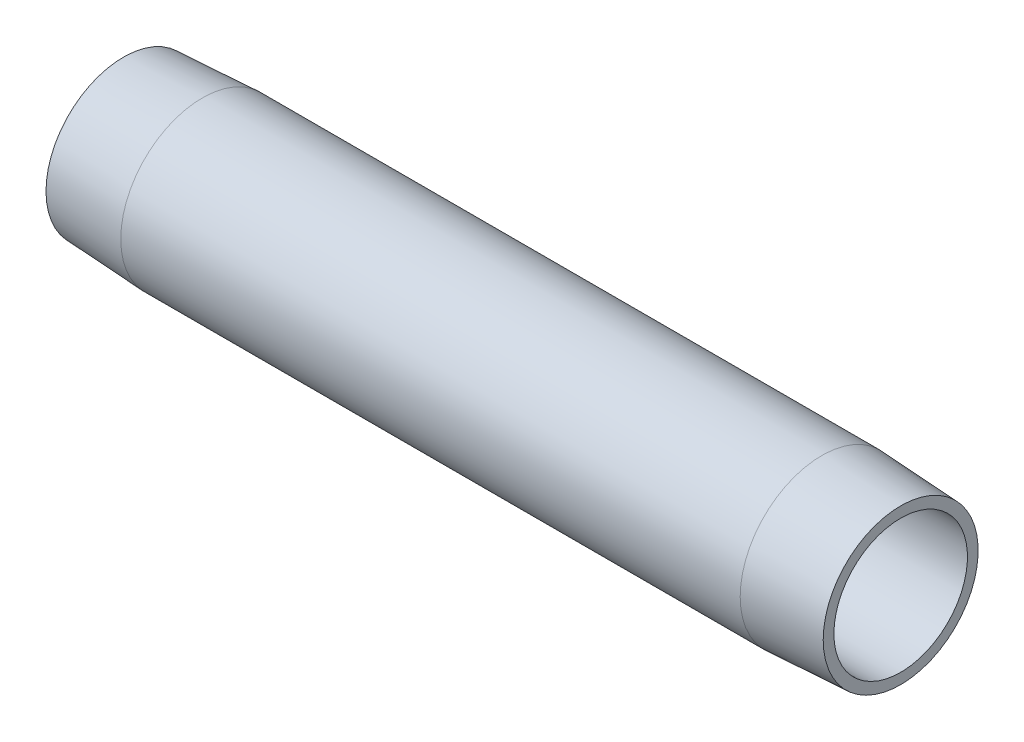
ISO-10303-21;
HEADER;
FILE_DESCRIPTION(('STEP AP214'),'2;1');
FILE_NAME('part.step','',(''),(''),'','','');
FILE_SCHEMA(('AUTOMOTIVE_DESIGN { 1 0 10303 214 1 1 1 1 }'));
ENDSEC;
DATA;
#1=APPLICATION_CONTEXT('core data for automotive mechanical design processes');
#2=APPLICATION_PROTOCOL_DEFINITION('international standard','automotive_design',2000,#1);
#3=PRODUCT_CONTEXT('',#1,'mechanical');
#4=PRODUCT('Part','Part','',(#3));
#5=PRODUCT_RELATED_PRODUCT_CATEGORY('part','',(#4));
#6=PRODUCT_DEFINITION_FORMATION('','',#4);
#7=PRODUCT_DEFINITION_CONTEXT('part definition',#1,'design');
#8=PRODUCT_DEFINITION('design','',#6,#7);
#9=PRODUCT_DEFINITION_SHAPE('','',#8);
#10=(LENGTH_UNIT() NAMED_UNIT(*) SI_UNIT(.MILLI.,.METRE.));
#11=(NAMED_UNIT(*) PLANE_ANGLE_UNIT() SI_UNIT($,.RADIAN.));
#12=(NAMED_UNIT(*) SI_UNIT($,.STERADIAN.) SOLID_ANGLE_UNIT());
#13=UNCERTAINTY_MEASURE_WITH_UNIT(LENGTH_MEASURE(1.E-05),#10,'distance_accuracy_value','');
#14=(GEOMETRIC_REPRESENTATION_CONTEXT(3) GLOBAL_UNCERTAINTY_ASSIGNED_CONTEXT((#13)) GLOBAL_UNIT_ASSIGNED_CONTEXT((#10,
#11,#12)) REPRESENTATION_CONTEXT('',''));
#15=CARTESIAN_POINT('',(0.,0.,0.));
#16=DIRECTION('',(0.,0.,1.));
#17=DIRECTION('',(1.,0.,0.));
#18=AXIS2_PLACEMENT_3D('',#15,#16,#17);
#19=CARTESIAN_POINT('',(101.6,8.73125,0.));
#20=DIRECTION('',(-1.,0.,0.));
#21=DIRECTION('',(0.,0.,1.));
#22=AXIS2_PLACEMENT_3D('',#19,#20,#21);
#23=PLANE('',#22);
#24=CARTESIAN_POINT('',(101.6,0.,0.));
#25=DIRECTION('',(-1.,0.,0.));
#26=DIRECTION('',(0.,0.,1.));
#27=AXIS2_PLACEMENT_3D('',#24,#25,#26);
#28=CIRCLE('',#27,10.1275500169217);
#29=CARTESIAN_POINT('',(101.6,0.,10.1275500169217));
#30=VERTEX_POINT('',#29);
#31=EDGE_CURVE('E10',#30,#30,#28,.T.);
#32=ORIENTED_EDGE('',*,*,#31,.F.);
#33=EDGE_LOOP('',(#32));
#34=FACE_BOUND('',#33,.T.);
#35=CARTESIAN_POINT('',(101.6,0.,0.));
#36=DIRECTION('',(-1.,0.,0.));
#37=DIRECTION('',(0.,0.,1.));
#38=AXIS2_PLACEMENT_3D('',#35,#36,#37);
#39=CIRCLE('',#38,8.73125);
#40=CARTESIAN_POINT('',(101.6,0.,8.73125));
#41=VERTEX_POINT('',#40);
#42=EDGE_CURVE('E52',#41,#41,#39,.T.);
#43=ORIENTED_EDGE('',*,*,#42,.T.);
#44=EDGE_LOOP('',(#43));
#45=FACE_BOUND('',#44,.T.);
#46=ADVANCED_FACE('F30',(#34,#45),#23,.F.);
#47=CARTESIAN_POINT('',(101.6,0.,0.));
#48=DIRECTION('',(-1.,0.,0.));
#49=DIRECTION('',(0.,0.,1.));
#50=AXIS2_PLACEMENT_3D('',#47,#48,#49);
#51=CONICAL_SURFACE('',#50,10.1275500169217,0.0523598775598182);
#52=CARTESIAN_POINT('',(91.2876,0.,0.));
#53=DIRECTION('',(-1.,0.,0.));
#54=DIRECTION('',(0.,0.,1.));
#55=AXIS2_PLACEMENT_3D('',#52,#53,#54);
#56=CIRCLE('',#55,10.668);
#57=CARTESIAN_POINT('',(91.2876,0.,10.668));
#58=VERTEX_POINT('',#57);
#59=EDGE_CURVE('E36',#58,#58,#56,.T.);
#60=ORIENTED_EDGE('',*,*,#59,.F.);
#61=EDGE_LOOP('',(#60));
#62=FACE_BOUND('',#61,.T.);
#63=ORIENTED_EDGE('',*,*,#31,.T.);
#64=EDGE_LOOP('',(#63));
#65=FACE_BOUND('',#64,.T.);
#66=ADVANCED_FACE('F77',(#62,#65),#51,.T.);
#67=CARTESIAN_POINT('',(0.,0.,0.));
#68=DIRECTION('',(-1.,0.,0.));
#69=DIRECTION('',(0.,0.,1.));
#70=AXIS2_PLACEMENT_3D('',#67,#68,#69);
#71=CYLINDRICAL_SURFACE('',#70,10.668);
#72=CARTESIAN_POINT('',(10.3124,0.,0.));
#73=DIRECTION('',(-1.,0.,0.));
#74=DIRECTION('',(0.,0.,1.));
#75=AXIS2_PLACEMENT_3D('',#72,#73,#74);
#76=CIRCLE('',#75,10.668);
#77=CARTESIAN_POINT('',(10.3124,0.,10.668));
#78=VERTEX_POINT('',#77);
#79=EDGE_CURVE('E40',#78,#78,#76,.T.);
#80=ORIENTED_EDGE('',*,*,#79,.F.);
#81=EDGE_LOOP('',(#80));
#82=FACE_BOUND('',#81,.T.);
#83=ORIENTED_EDGE('',*,*,#59,.T.);
#84=EDGE_LOOP('',(#83));
#85=FACE_BOUND('',#84,.T.);
#86=ADVANCED_FACE('F72',(#82,#85),#71,.T.);
#87=CARTESIAN_POINT('',(10.3124,0.,0.));
#88=DIRECTION('',(1.,0.,0.));
#89=DIRECTION('',(0.,0.,-1.));
#90=AXIS2_PLACEMENT_3D('',#87,#88,#89);
#91=CONICAL_SURFACE('',#90,10.668,0.0523598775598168);
#92=CARTESIAN_POINT('',(0.,0.,0.));
#93=DIRECTION('',(-1.,0.,0.));
#94=DIRECTION('',(0.,0.,1.));
#95=AXIS2_PLACEMENT_3D('',#92,#93,#94);
#96=CIRCLE('',#95,10.1275500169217);
#97=CARTESIAN_POINT('',(0.,0.,10.1275500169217));
#98=VERTEX_POINT('',#97);
#99=EDGE_CURVE('E44',#98,#98,#96,.T.);
#100=ORIENTED_EDGE('',*,*,#99,.F.);
#101=EDGE_LOOP('',(#100));
#102=FACE_BOUND('',#101,.T.);
#103=ORIENTED_EDGE('',*,*,#79,.T.);
#104=EDGE_LOOP('',(#103));
#105=FACE_BOUND('',#104,.T.);
#106=ADVANCED_FACE('F66',(#102,#105),#91,.T.);
#107=CARTESIAN_POINT('',(0.,10.1275500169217,0.));
#108=DIRECTION('',(1.,0.,0.));
#109=DIRECTION('',(0.,0.,-1.));
#110=AXIS2_PLACEMENT_3D('',#107,#108,#109);
#111=PLANE('',#110);
#112=CARTESIAN_POINT('',(0.,0.,0.));
#113=DIRECTION('',(-1.,0.,0.));
#114=DIRECTION('',(0.,0.,1.));
#115=AXIS2_PLACEMENT_3D('',#112,#113,#114);
#116=CIRCLE('',#115,8.73125);
#117=CARTESIAN_POINT('',(0.,0.,8.73125));
#118=VERTEX_POINT('',#117);
#119=EDGE_CURVE('E49',#118,#118,#116,.T.);
#120=ORIENTED_EDGE('',*,*,#119,.F.);
#121=EDGE_LOOP('',(#120));
#122=FACE_BOUND('',#121,.T.);
#123=ORIENTED_EDGE('',*,*,#99,.T.);
#124=EDGE_LOOP('',(#123));
#125=FACE_BOUND('',#124,.T.);
#126=ADVANCED_FACE('F60',(#122,#125),#111,.F.);
#127=CARTESIAN_POINT('',(0.,0.,0.));
#128=DIRECTION('',(-1.,0.,0.));
#129=DIRECTION('',(0.,0.,1.));
#130=AXIS2_PLACEMENT_3D('',#127,#128,#129);
#131=CYLINDRICAL_SURFACE('',#130,8.73125);
#132=ORIENTED_EDGE('',*,*,#42,.F.);
#133=EDGE_LOOP('',(#132));
#134=FACE_BOUND('',#133,.T.);
#135=ORIENTED_EDGE('',*,*,#119,.T.);
#136=EDGE_LOOP('',(#135));
#137=FACE_BOUND('',#136,.T.);
#138=ADVANCED_FACE('F57',(#134,#137),#131,.F.);
#139=CLOSED_SHELL('',(#46,#66,#86,#106,#126,#138));
#140=MANIFOLD_SOLID_BREP('B2',#139);
#141=ADVANCED_BREP_SHAPE_REPRESENTATION('',(#18,#140),#14);
#142=SHAPE_DEFINITION_REPRESENTATION(#9,#141);
ENDSEC;
END-ISO-10303-21;
